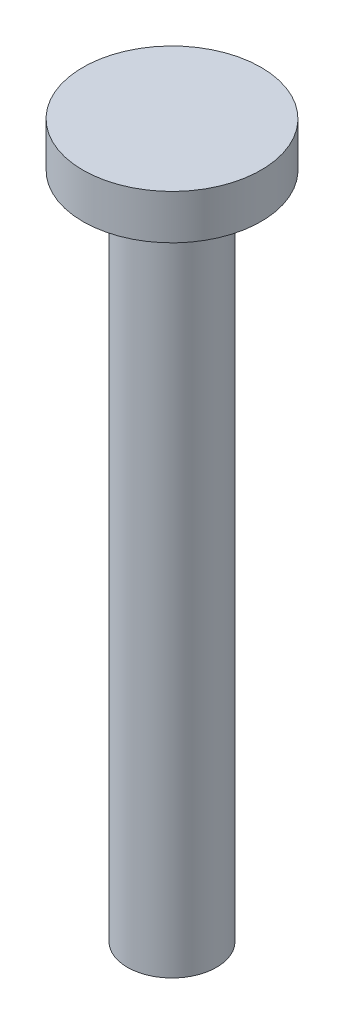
from build123d import *

# Parameters (mm, degrees)
SKIZZE1_R               = 1
LINEAR_AUSTRAGEN1_DEPTH = 15
SKIZZE2_R               = 2
LINEAR_AUSTRAGEN2_DEPTH = 1


with BuildPart() as part:
    # Skizze1 → Linear austragen1 (new body)
    with BuildSketch(Plane(origin=(0, 0, 0), x_dir=(1, 0, 0), z_dir=(0, 1, 0))):
        with Locations(Location((0, 0, 0), (0, 0, 270))):
            Circle(SKIZZE1_R)
    extrude(amount=LINEAR_AUSTRAGEN1_DEPTH)

    # Skizze2 → Linear austragen2 (add)
    with BuildSketch(Plane(origin=(0, 15, 0), x_dir=(-1, 0, 0), z_dir=(0, 1, 0))):
        with Locations(Location((0, 0, 0), (0, 0, 90))):
            Circle(SKIZZE2_R)
    extrude(amount=LINEAR_AUSTRAGEN2_DEPTH)


solid = part.part
